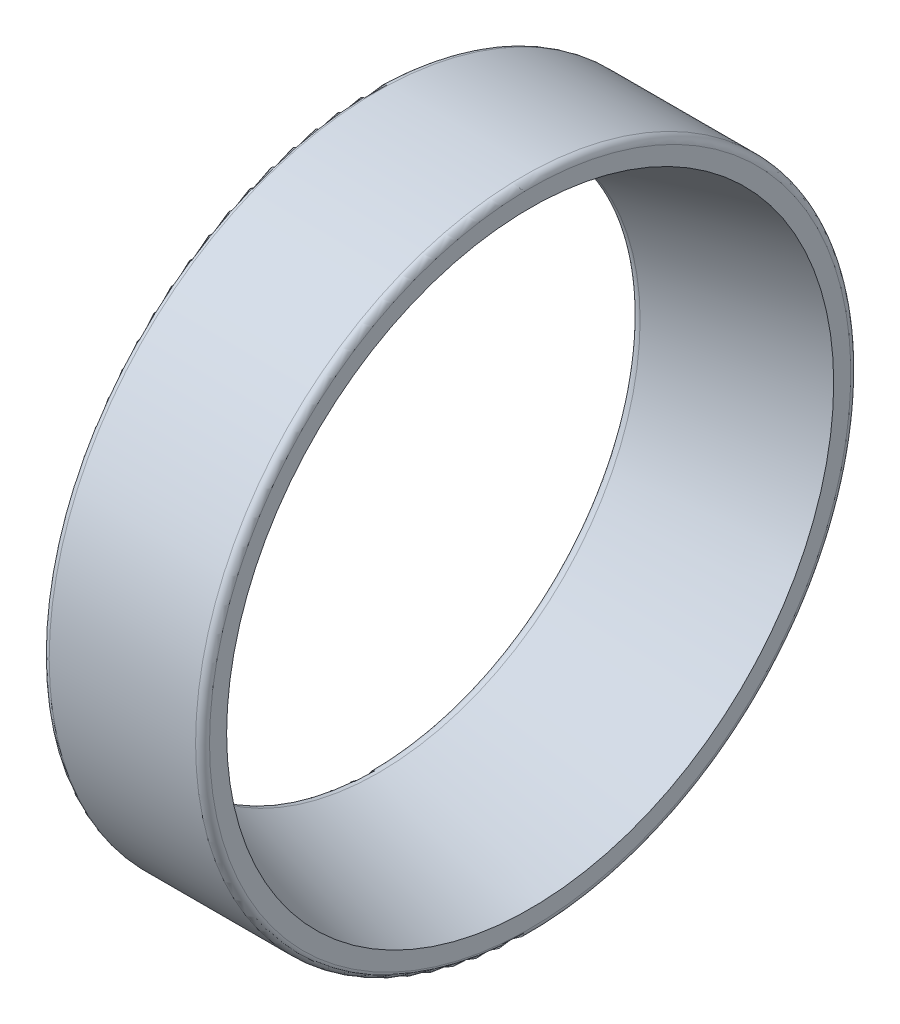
from build123d import *


with BuildPart() as part:
    # Esquisse1 → Base-R_volution (revolve)
    with BuildSketch(Plane(origin=(0, 0, 0), x_dir=(1, 0, 0), z_dir=(0, 1, 0)), mode=Mode.PRIVATE) as base_r_volution_sk:
        with BuildLine():
            Line((0, 19.234778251), (0, 23))
            ThreePointArc((0, 23), (0.146446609, 23.353553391), (0.5, 23.5))
            Line((0.5, 23.5), (11, 23.5))
            ThreePointArc((11, 23.5), (11.353553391, 23.353553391), (11.5, 23))
            Line((11.5, 23), (11.5, 21.772361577))
            Line((11.5, 21.772361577), (10.306882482, 21.440834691))
            Line((10.306882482, 21.440834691), (0.874735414, 18.819960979))
            Line((0.874735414, 18.819960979), (0.633861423, 18.753030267))
            ThreePointArc((0.633861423, 18.753030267), (0.197453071, 18.836701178), (0, 19.234778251))
        make_face()
    revolve(base_r_volution_sk.sketch.rotate(Axis((0, 0, 0), (1, 0, 0)), 180), axis=Axis((0, 0, 0), (1, 0, 0)))


solid = part.part
